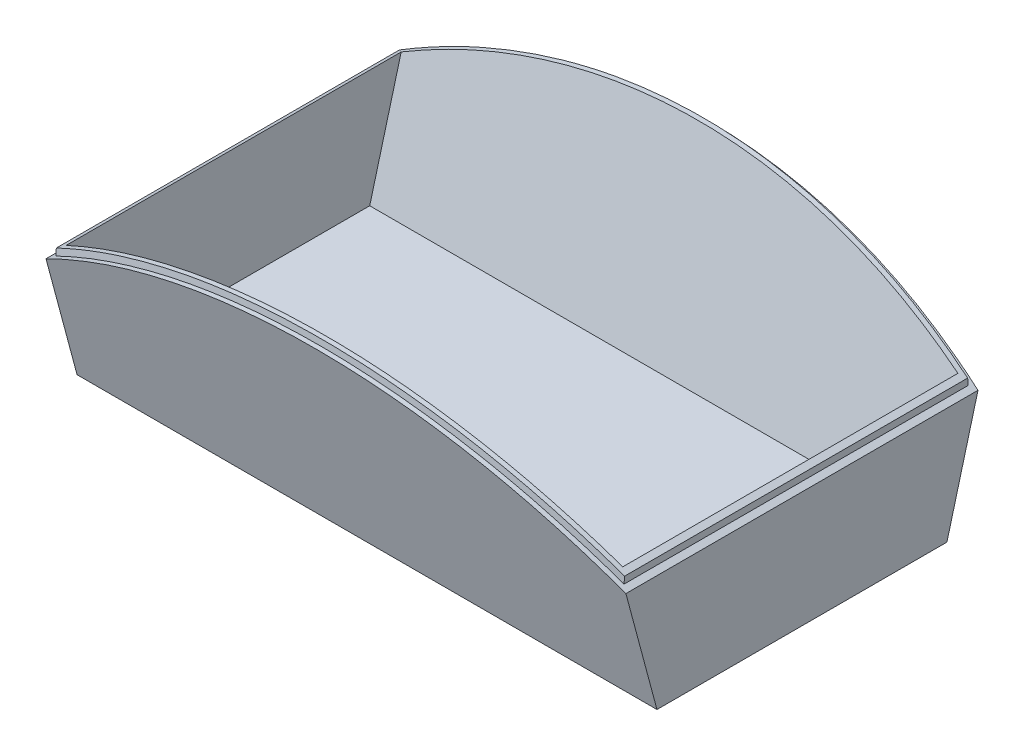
ISO-10303-21;
HEADER;
FILE_DESCRIPTION(('STEP AP214'),'2;1');
FILE_NAME('part.step','',(''),(''),'','','');
FILE_SCHEMA(('AUTOMOTIVE_DESIGN { 1 0 10303 214 1 1 1 1 }'));
ENDSEC;
DATA;
#1=APPLICATION_CONTEXT('core data for automotive mechanical design processes');
#2=APPLICATION_PROTOCOL_DEFINITION('international standard','automotive_design',2000,#1);
#3=PRODUCT_CONTEXT('',#1,'mechanical');
#4=PRODUCT('Part','Part','',(#3));
#5=PRODUCT_RELATED_PRODUCT_CATEGORY('part','',(#4));
#6=PRODUCT_DEFINITION_FORMATION('','',#4);
#7=PRODUCT_DEFINITION_CONTEXT('part definition',#1,'design');
#8=PRODUCT_DEFINITION('design','',#6,#7);
#9=PRODUCT_DEFINITION_SHAPE('','',#8);
#10=(LENGTH_UNIT() NAMED_UNIT(*) SI_UNIT(.MILLI.,.METRE.));
#11=(NAMED_UNIT(*) PLANE_ANGLE_UNIT() SI_UNIT($,.RADIAN.));
#12=(NAMED_UNIT(*) SI_UNIT($,.STERADIAN.) SOLID_ANGLE_UNIT());
#13=UNCERTAINTY_MEASURE_WITH_UNIT(LENGTH_MEASURE(1.E-05),#10,'distance_accuracy_value','');
#14=(GEOMETRIC_REPRESENTATION_CONTEXT(3) GLOBAL_UNCERTAINTY_ASSIGNED_CONTEXT((#13)) GLOBAL_UNIT_ASSIGNED_CONTEXT((#10,
#11,#12)) REPRESENTATION_CONTEXT('',''));
#15=CARTESIAN_POINT('',(0.,0.,0.));
#16=DIRECTION('',(0.,0.,1.));
#17=DIRECTION('',(1.,0.,0.));
#18=AXIS2_PLACEMENT_3D('',#15,#16,#17);
#19=CARTESIAN_POINT('',(0.,-66.6025403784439,-50.));
#20=DIRECTION('',(0.,0.,1.));
#21=DIRECTION('',(1.,0.,0.));
#22=AXIS2_PLACEMENT_3D('',#19,#20,#21);
#23=CYLINDRICAL_SURFACE('',#22,101.);
#24=CARTESIAN_POINT('',(0.,-66.6025403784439,5.08335073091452));
#25=DIRECTION('',(0.,-0.258819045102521,0.965925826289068));
#26=DIRECTION('',(0.,0.965925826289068,0.258819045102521));
#27=AXIS2_PLACEMENT_3D('',#24,#25,#26);
#28=ELLIPSE('',#27,104.562894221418,101.);
#29=CARTESIAN_POINT('',(48.,22.2625258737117,28.8946734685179));
#30=VERTEX_POINT('',#29);
#31=CARTESIAN_POINT('',(-48.,22.2625258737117,28.8946734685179));
#32=VERTEX_POINT('',#31);
#33=EDGE_CURVE('E572',#30,#32,#28,.T.);
#34=ORIENTED_EDGE('',*,*,#33,.T.);
#35=DIRECTION('',(0.,0.,1.));
#36=VECTOR('',#35,1.);
#37=CARTESIAN_POINT('',(-48.,22.2625258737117,-50.));
#38=LINE('',#37,#36);
#39=CARTESIAN_POINT('',(-48.,22.2625258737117,-28.8946734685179));
#40=VERTEX_POINT('',#39);
#41=EDGE_CURVE('E549',#32,#40,#38,.F.);
#42=ORIENTED_EDGE('',*,*,#41,.T.);
#43=CARTESIAN_POINT('',(0.,-66.6025403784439,-5.08335073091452));
#44=DIRECTION('',(0.,-0.258819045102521,-0.965925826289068));
#45=DIRECTION('',(0.,-0.965925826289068,0.258819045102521));
#46=AXIS2_PLACEMENT_3D('',#43,#44,#45);
#47=ELLIPSE('',#46,104.562894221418,101.);
#48=CARTESIAN_POINT('',(48.,22.2625258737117,-28.8946734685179));
#49=VERTEX_POINT('',#48);
#50=EDGE_CURVE('E530',#49,#40,#47,.F.);
#51=ORIENTED_EDGE('',*,*,#50,.F.);
#52=DIRECTION('',(0.,0.,1.));
#53=VECTOR('',#52,1.);
#54=CARTESIAN_POINT('',(48.,22.2625258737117,-50.));
#55=LINE('',#54,#53);
#56=EDGE_CURVE('E570',#49,#30,#55,.T.);
#57=ORIENTED_EDGE('',*,*,#56,.T.);
#58=EDGE_LOOP('',(#34,#42,#51,#57));
#59=FACE_BOUND('',#58,.T.);
#60=DIRECTION('',(0.,0.,1.));
#61=VECTOR('',#60,1.);
#62=CARTESIAN_POINT('',(-49.,21.7150682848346,-50.));
#63=LINE('',#62,#61);
#64=CARTESIAN_POINT('',(-49.,21.7150682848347,29.5815752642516));
#65=VERTEX_POINT('',#64);
#66=CARTESIAN_POINT('',(-49.,21.7150682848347,-29.5815752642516));
#67=VERTEX_POINT('',#66);
#68=EDGE_CURVE('E564',#65,#67,#63,.F.);
#69=ORIENTED_EDGE('',*,*,#68,.F.);
#70=CARTESIAN_POINT('',(49.0000000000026,21.7150682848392,29.5815752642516));
#71=CARTESIAN_POINT('',(48.3355022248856,22.0837471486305,29.6804127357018));
#72=CARTESIAN_POINT('',(47.6665909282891,22.4450583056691,29.7772989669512));
#73=CARTESIAN_POINT('',(45.645444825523,23.5074576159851,30.0622166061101));
#74=CARTESIAN_POINT('',(44.2804635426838,24.1860374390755,30.2442458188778));
#75=CARTESIAN_POINT('',(41.5194061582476,25.4814668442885,30.5916265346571));
#76=CARTESIAN_POINT('',(40.1233298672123,26.0983160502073,30.7569779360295));
#77=CARTESIAN_POINT('',(38.0089427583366,26.9757794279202,30.9921097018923));
#78=CARTESIAN_POINT('',(37.3011226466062,27.2601702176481,31.0683033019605));
#79=CARTESIAN_POINT('',(35.8788417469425,27.8129814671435,31.2164040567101));
#80=CARTESIAN_POINT('',(35.1643811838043,28.0814024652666,31.2883113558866));
#81=CARTESIAN_POINT('',(33.7284644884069,28.602367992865,31.4279051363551));
#82=CARTESIAN_POINT('',(33.007002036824,28.8548962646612,31.4955872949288));
#83=CARTESIAN_POINT('',(31.5581794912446,29.3436209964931,31.6267274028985));
#84=CARTESIAN_POINT('',(30.8308192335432,29.57981700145,31.6901852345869));
#85=CARTESIAN_POINT('',(28.6402467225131,30.2637416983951,31.8740986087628));
#86=CARTESIAN_POINT('',(27.1686769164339,30.6867583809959,31.9880809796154));
#87=CARTESIAN_POINT('',(24.2066635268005,31.4657161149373,32.1980046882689));
#88=CARTESIAN_POINT('',(22.7162195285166,31.8216556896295,32.2939456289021));
#89=CARTESIAN_POINT('',(19.7198370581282,32.4654940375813,32.4672674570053));
#90=CARTESIAN_POINT('',(18.2139014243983,32.7534050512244,32.5446516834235));
#91=CARTESIAN_POINT('',(15.9466193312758,33.1335713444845,32.6465666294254));
#92=CARTESIAN_POINT('',(15.1898284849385,33.2516323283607,32.6781662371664));
#93=CARTESIAN_POINT('',(13.6735570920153,33.4705361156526,32.7366577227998));
#94=CARTESIAN_POINT('',(12.9140764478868,33.5713782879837,32.7635494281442));
#95=CARTESIAN_POINT('',(10.6249313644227,33.8488455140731,32.8373864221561));
#96=CARTESIAN_POINT('',(9.09172582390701,33.9992094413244,32.8771716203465));
#97=CARTESIAN_POINT('',(6.78777490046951,34.1720580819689,32.9226844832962));
#98=CARTESIAN_POINT('',(6.01901788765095,34.2208938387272,32.9354952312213));
#99=CARTESIAN_POINT('',(4.48050813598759,34.300969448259,32.9564425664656));
#100=CARTESIAN_POINT('',(3.71075540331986,34.3322094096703,32.9645791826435));
#101=CARTESIAN_POINT('',(2.16965781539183,34.3770994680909,32.9762359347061));
#102=CARTESIAN_POINT('',(1.39831221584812,34.3907256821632,32.9797498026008));
#103=CARTESIAN_POINT('',(0.241221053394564,34.3979080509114,32.9816124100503));
#104=CARTESIAN_POINT('',(-0.144490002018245,34.3980926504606,32.9816652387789));
#105=CARTESIAN_POINT('',(-0.915888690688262,34.394043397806,32.9805666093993));
#106=CARTESIAN_POINT('',(-1.30157632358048,34.3898094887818,32.9794151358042));
#107=CARTESIAN_POINT('',(-3.22989091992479,34.3575904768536,32.9706799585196));
#108=CARTESIAN_POINT('',(-4.77207601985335,34.2964570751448,32.9541628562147));
#109=CARTESIAN_POINT('',(-8.14085126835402,34.0855158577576,32.8975263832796));
#110=CARTESIAN_POINT('',(-9.96647142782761,33.9212132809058,32.8535576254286));
#111=CARTESIAN_POINT('',(-13.6059307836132,33.4935999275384,32.7392906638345));
#112=CARTESIAN_POINT('',(-15.4197651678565,33.2302510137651,32.6689823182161));
#113=CARTESIAN_POINT('',(-19.029713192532,32.6054515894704,32.5017925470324));
#114=CARTESIAN_POINT('',(-20.8258231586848,32.2439811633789,32.4049057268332));
#115=CARTESIAN_POINT('',(-23.501862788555,31.6293311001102,32.2399587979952));
#116=CARTESIAN_POINT('',(-24.3908769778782,31.4123673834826,32.1817053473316));
#117=CARTESIAN_POINT('',(-26.162287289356,30.9544761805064,32.0587559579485));
#118=CARTESIAN_POINT('',(-27.0446834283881,30.7135487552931,31.9940600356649));
#119=CARTESIAN_POINT('',(-28.8019784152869,30.2080053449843,31.8583826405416));
#120=CARTESIAN_POINT('',(-29.6768787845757,29.943394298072,31.7874024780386));
#121=CARTESIAN_POINT('',(-31.4186778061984,29.390697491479,31.63926757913));
#122=CARTESIAN_POINT('',(-32.2855763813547,29.1026115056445,31.5621127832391));
#123=CARTESIAN_POINT('',(-34.8724894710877,28.2037906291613,31.3213981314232));
#124=CARTESIAN_POINT('',(-36.579743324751,27.5581986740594,31.1485092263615));
#125=CARTESIAN_POINT('',(-39.1883095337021,26.4902538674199,30.8623146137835));
#126=CARTESIAN_POINT('',(-40.1037283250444,26.0995678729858,30.75758004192));
#127=CARTESIAN_POINT('',(-41.9217620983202,25.2917189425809,30.5409479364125));
#128=CARTESIAN_POINT('',(-42.824379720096,24.8745615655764,30.4290519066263));
#129=CARTESIAN_POINT('',(-44.6140201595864,24.0151852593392,30.1985072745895));
#130=CARTESIAN_POINT('',(-45.5010751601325,23.5730287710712,30.0798754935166));
#131=CARTESIAN_POINT('',(-47.2612350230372,22.6631170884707,29.8357890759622));
#132=CARTESIAN_POINT('',(-48.1343370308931,22.1953567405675,29.710333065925));
#133=CARTESIAN_POINT('',(-49.,21.7150682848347,29.5815752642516));
#134=B_SPLINE_CURVE_WITH_KNOTS('',3,(#70,#71,#72,#73,#74,#75,#76,#77,#78,#79,#80,#81,#82,#83,
#84,#85,#86,#87,#88,#89,#90,#91,#92,#93,#94,#95,#96,#97,#98,#99,#100,#101,#102,#103,#104,#105,
#106,#107,#108,#109,#110,#111,#112,#113,#114,#115,#116,#117,#118,#119,#120,#121,#122,#123,#124,
#125,#126,#127,#128,#129,#130,#131,#132,#133),.UNSPECIFIED.,.F.,.F.,(4,2,2,2,2,2,2,2,2,2,2,2,2,
2,2,2,2,2,2,2,2,2,2,2,2,2,2,2,2,2,2,4),(0.,2.29899845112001,6.90283129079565,11.5066921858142,
13.8063535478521,16.1059373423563,18.4078365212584,20.7097998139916,25.3141560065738,
29.9186135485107,34.5222419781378,36.8218434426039,39.1215291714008,43.7426877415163,
46.0537643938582,48.3648267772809,50.6790195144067,51.8361271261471,52.9932496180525,
57.6218107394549,63.1194614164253,68.6192311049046,74.1201179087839,76.8706980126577,
79.621271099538,82.3712720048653,85.1212994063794,90.6181593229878,93.6201934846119,
96.6215992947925,99.6158138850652,102.610633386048),.UNSPECIFIED.);
#135=CARTESIAN_POINT('',(49.0000000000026,21.7150682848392,29.5815752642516));
#136=VERTEX_POINT('',#135);
#137=EDGE_CURVE('E569',#136,#65,#134,.T.);
#138=ORIENTED_EDGE('',*,*,#137,.F.);
#139=DIRECTION('',(0.,0.,1.));
#140=VECTOR('',#139,1.);
#141=CARTESIAN_POINT('',(49.,21.7150682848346,-50.));
#142=LINE('',#141,#140);
#143=CARTESIAN_POINT('',(49.0000000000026,21.7150682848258,-29.5815752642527));
#144=VERTEX_POINT('',#143);
#145=EDGE_CURVE('E567',#144,#136,#142,.T.);
#146=ORIENTED_EDGE('',*,*,#145,.F.);
#147=CARTESIAN_POINT('',(49.0000000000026,21.7150682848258,-29.5815752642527));
#148=CARTESIAN_POINT('',(48.3355022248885,22.0837471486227,-29.6804127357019));
#149=CARTESIAN_POINT('',(47.6665909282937,22.4450583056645,-29.7772989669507));
#150=CARTESIAN_POINT('',(45.6454448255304,23.5074576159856,-30.0622166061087));
#151=CARTESIAN_POINT('',(44.28046354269,24.1860374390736,-30.2442458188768));
#152=CARTESIAN_POINT('',(41.519406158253,25.4814668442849,-30.5916265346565));
#153=CARTESIAN_POINT('',(40.123329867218,26.0983160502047,-30.7569779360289));
#154=CARTESIAN_POINT('',(38.0089427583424,26.975779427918,-30.9921097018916));
#155=CARTESIAN_POINT('',(37.301122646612,27.2601702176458,-31.0683033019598));
#156=CARTESIAN_POINT('',(35.8788417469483,27.8129814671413,-31.2164040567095));
#157=CARTESIAN_POINT('',(35.1643811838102,28.0814024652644,-31.288311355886));
#158=CARTESIAN_POINT('',(33.7284644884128,28.602367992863,-31.4279051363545));
#159=CARTESIAN_POINT('',(33.0070020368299,28.8548962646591,-31.4955872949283));
#160=CARTESIAN_POINT('',(31.5581794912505,29.3436209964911,-31.626727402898));
#161=CARTESIAN_POINT('',(30.8308192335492,29.579817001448,-31.6901852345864));
#162=CARTESIAN_POINT('',(28.6402467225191,30.2637416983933,-31.8740986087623));
#163=CARTESIAN_POINT('',(27.16867691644,30.6867583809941,-31.988080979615));
#164=CARTESIAN_POINT('',(24.2066635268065,31.4657161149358,-32.1980046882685));
#165=CARTESIAN_POINT('',(22.7162195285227,31.8216556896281,-32.2939456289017));
#166=CARTESIAN_POINT('',(19.7198370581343,32.4654940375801,-32.4672674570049));
#167=CARTESIAN_POINT('',(18.2139014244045,32.7534050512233,-32.5446516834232));
#168=CARTESIAN_POINT('',(15.946619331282,33.1335713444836,-32.6465666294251));
#169=CARTESIAN_POINT('',(15.1898284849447,33.2516323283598,-32.6781662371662));
#170=CARTESIAN_POINT('',(13.6735570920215,33.4705361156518,-32.7366577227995));
#171=CARTESIAN_POINT('',(12.9140764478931,33.5713782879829,-32.7635494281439));
#172=CARTESIAN_POINT('',(10.6249313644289,33.8488455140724,-32.8373864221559));
#173=CARTESIAN_POINT('',(9.09172582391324,33.9992094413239,-32.8771716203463));
#174=CARTESIAN_POINT('',(6.78777490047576,34.1720580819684,-32.9226844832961));
#175=CARTESIAN_POINT('',(6.01901788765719,34.2208938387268,-32.9354952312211));
#176=CARTESIAN_POINT('',(4.48050813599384,34.3009694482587,-32.9564425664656));
#177=CARTESIAN_POINT('',(3.71075540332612,34.3322094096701,-32.9645791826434));
#178=CARTESIAN_POINT('',(2.16965781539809,34.3770994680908,-32.976235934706));
#179=CARTESIAN_POINT('',(1.39831221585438,34.3907256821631,-32.9797498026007));
#180=CARTESIAN_POINT('',(0.241221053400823,34.3979080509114,-32.9816124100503));
#181=CARTESIAN_POINT('',(-0.144490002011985,34.3980926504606,-32.9816652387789));
#182=CARTESIAN_POINT('',(-0.915888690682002,34.394043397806,-32.9805666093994));
#183=CARTESIAN_POINT('',(-1.30157632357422,34.3898094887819,-32.9794151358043));
#184=CARTESIAN_POINT('',(-3.22989091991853,34.3575904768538,-32.9706799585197));
#185=CARTESIAN_POINT('',(-4.77207601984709,34.2964570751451,-32.9541628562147));
#186=CARTESIAN_POINT('',(-8.14085126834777,34.0855158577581,-32.8975263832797));
#187=CARTESIAN_POINT('',(-9.96647142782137,33.9212132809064,-32.8535576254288));
#188=CARTESIAN_POINT('',(-13.605930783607,33.4935999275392,-32.7392906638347));
#189=CARTESIAN_POINT('',(-15.4197651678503,33.230251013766,-32.6689823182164));
#190=CARTESIAN_POINT('',(-19.0297131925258,32.6054515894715,-32.5017925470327));
#191=CARTESIAN_POINT('',(-20.8258231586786,32.2439811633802,-32.4049057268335));
#192=CARTESIAN_POINT('',(-23.5018627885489,31.6293311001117,-32.2399587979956));
#193=CARTESIAN_POINT('',(-24.3908769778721,31.4123673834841,-32.181705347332));
#194=CARTESIAN_POINT('',(-26.1622872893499,30.954476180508,-32.0587559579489));
#195=CARTESIAN_POINT('',(-27.0446834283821,30.7135487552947,-31.9940600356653));
#196=CARTESIAN_POINT('',(-28.8019784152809,30.2080053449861,-31.8583826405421));
#197=CARTESIAN_POINT('',(-29.6768787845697,29.9433942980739,-31.7874024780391));
#198=CARTESIAN_POINT('',(-31.4186778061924,29.3906974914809,-31.6392675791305));
#199=CARTESIAN_POINT('',(-32.2855763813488,29.1026115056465,-31.5621127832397));
#200=CARTESIAN_POINT('',(-34.8724894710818,28.2037906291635,-31.3213981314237));
#201=CARTESIAN_POINT('',(-36.5797433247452,27.5581986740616,-31.1485092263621));
#202=CARTESIAN_POINT('',(-39.1883095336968,26.4902538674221,-30.8623146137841));
#203=CARTESIAN_POINT('',(-40.1037283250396,26.0995678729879,-30.7575800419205));
#204=CARTESIAN_POINT('',(-41.9217620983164,25.2917189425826,-30.540947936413));
#205=CARTESIAN_POINT('',(-42.8243797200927,24.874561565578,-30.4290519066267));
#206=CARTESIAN_POINT('',(-44.6140201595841,24.0151852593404,-30.1985072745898));
#207=CARTESIAN_POINT('',(-45.5010751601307,23.5730287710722,-30.0798754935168));
#208=CARTESIAN_POINT('',(-47.2612350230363,22.6631170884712,-29.8357890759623));
#209=CARTESIAN_POINT('',(-48.1343370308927,22.1953567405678,-29.710333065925));
#210=CARTESIAN_POINT('',(-49.,21.7150682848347,-29.5815752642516));
#211=B_SPLINE_CURVE_WITH_KNOTS('',3,(#147,#148,#149,#150,#151,#152,#153,#154,#155,#156,#157,
#158,#159,#160,#161,#162,#163,#164,#165,#166,#167,#168,#169,#170,#171,#172,#173,#174,#175,#176,
#177,#178,#179,#180,#181,#182,#183,#184,#185,#186,#187,#188,#189,#190,#191,#192,#193,#194,#195,
#196,#197,#198,#199,#200,#201,#202,#203,#204,#205,#206,#207,#208,#209,#210),.UNSPECIFIED.,.F.,
.F.,(4,2,2,2,2,2,2,2,2,2,2,2,2,2,2,2,2,2,2,2,2,2,2,2,2,2,2,2,2,2,2,4),(0.,2.29899845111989,
6.90283129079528,11.506692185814,13.806353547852,16.1059373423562,18.4078365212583,
20.7097998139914,25.3141560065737,29.9186135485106,34.5222419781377,36.8218434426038,
39.1215291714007,43.7426877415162,46.0537643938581,48.3648267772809,50.6790195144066,
51.836127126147,52.9932496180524,57.6218107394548,63.1194614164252,68.6192311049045,
74.1201179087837,76.8706980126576,79.6212710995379,82.3712720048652,85.1212994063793,
90.6181593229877,93.6201934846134,96.6215992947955,99.6158138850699,102.610633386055),.UNSPECIFIED.);
#212=EDGE_CURVE('E415',#144,#67,#211,.T.);
#213=ORIENTED_EDGE('',*,*,#212,.T.);
#214=EDGE_LOOP('',(#69,#138,#146,#213));
#215=FACE_BOUND('',#214,.T.);
#216=ADVANCED_FACE('F391',(#59,#215),#23,.T.);
#217=CARTESIAN_POINT('',(-49.,21.7265219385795,-29.5806102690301));
#218=CARTESIAN_POINT('',(-43.473818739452,24.7921293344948,-30.4024231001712));
#219=CARTESIAN_POINT('',(-36.7016954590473,27.7668626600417,-31.199898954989));
#220=CARTESIAN_POINT('',(-24.3959993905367,31.5993838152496,-32.2273493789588));
#221=CARTESIAN_POINT('',(-13.9567033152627,33.7882441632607,-32.8141664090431));
#222=CARTESIAN_POINT('',(-4.25655860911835,34.409595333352,-32.9807474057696));
#223=CARTESIAN_POINT('',(10.8177246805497,34.4020766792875,-32.9787317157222));
#224=CARTESIAN_POINT('',(22.3248052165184,32.5561956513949,-32.4838537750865));
#225=CARTESIAN_POINT('',(38.5558555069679,26.9504739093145,-30.9810388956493));
#226=CARTESIAN_POINT('',(44.3544069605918,24.3036326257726,-30.2714692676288));
#227=CARTESIAN_POINT('',(49.0000000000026,21.7265219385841,-29.5806102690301));
#228=CARTESIAN_POINT('',(-49.,21.7227040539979,-29.5809319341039));
#229=CARTESIAN_POINT('',(-43.4737218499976,24.7885002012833,-30.4027927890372));
#230=CARTESIAN_POINT('',(-36.7013756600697,27.7634071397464,-31.2003125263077));
#231=CARTESIAN_POINT('',(-24.3959671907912,31.5959546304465,-32.2277665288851));
#232=CARTESIAN_POINT('',(-13.9565304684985,33.7849129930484,-32.814607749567));
#233=CARTESIAN_POINT('',(-4.25661273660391,34.406256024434,-32.9811859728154));
#234=CARTESIAN_POINT('',(10.8173658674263,34.3987584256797,-32.9791759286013));
#235=CARTESIAN_POINT('',(22.3252898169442,32.5526614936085,-32.4842419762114));
#236=CARTESIAN_POINT('',(38.5559170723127,26.946837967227,-30.9814048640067));
#237=CARTESIAN_POINT('',(44.3544599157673,24.2998978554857,-30.2718110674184));
#238=CARTESIAN_POINT('',(49.0000000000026,21.7227040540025,-29.5809319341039));
#239=CARTESIAN_POINT('',(-49.,21.7188861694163,-29.5812535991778));
#240=CARTESIAN_POINT('',(-43.4736249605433,24.7848710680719,-30.4031624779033));
#241=CARTESIAN_POINT('',(-36.7010558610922,27.7599516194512,-31.2007260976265));
#242=CARTESIAN_POINT('',(-24.3959349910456,31.5925254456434,-32.2281836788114));
#243=CARTESIAN_POINT('',(-13.9563576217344,33.781581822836,-32.8150490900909));
#244=CARTESIAN_POINT('',(-4.25666686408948,34.4029167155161,-32.9816245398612));
#245=CARTESIAN_POINT('',(10.8170070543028,34.3954401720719,-32.9796201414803));
#246=CARTESIAN_POINT('',(22.32577441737,32.5491273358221,-32.4846301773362));
#247=CARTESIAN_POINT('',(38.5559786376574,26.9432020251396,-30.981770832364));
#248=CARTESIAN_POINT('',(44.3545128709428,24.2961630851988,-30.272152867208));
#249=CARTESIAN_POINT('',(49.0000000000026,21.7188861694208,-29.5812535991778));
#250=CARTESIAN_POINT('',(-49.,21.7150682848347,-29.5815752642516));
#251=CARTESIAN_POINT('',(-43.473528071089,24.7812419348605,-30.4035321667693));
#252=CARTESIAN_POINT('',(-36.7007360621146,27.7564960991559,-31.2011396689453));
#253=CARTESIAN_POINT('',(-24.3959027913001,31.5890962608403,-32.2286008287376));
#254=CARTESIAN_POINT('',(-13.9561847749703,33.7782506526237,-32.8154904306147));
#255=CARTESIAN_POINT('',(-4.25672099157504,34.3995774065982,-32.982063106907));
#256=CARTESIAN_POINT('',(10.8166482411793,34.3921219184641,-32.9800643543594));
#257=CARTESIAN_POINT('',(22.3262590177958,32.5455931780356,-32.485018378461));
#258=CARTESIAN_POINT('',(38.5560402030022,26.9395660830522,-30.9821368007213));
#259=CARTESIAN_POINT('',(44.3545658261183,24.2924283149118,-30.2724946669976));
#260=CARTESIAN_POINT('',(49.0000000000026,21.7150682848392,-29.5815752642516));
#261=CARTESIAN_POINT('',(-49.,21.3332798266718,-29.6137417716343));
#262=CARTESIAN_POINT('',(-43.4638391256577,24.4183286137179,-30.4405010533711));
#263=CARTESIAN_POINT('',(-36.6687561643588,27.4109440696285,-31.2424968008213));
#264=CARTESIAN_POINT('',(-24.3926828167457,31.2461777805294,-32.2703158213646));
#265=CARTESIAN_POINT('',(-13.9389000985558,33.4451336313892,-32.8596244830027));
#266=CARTESIAN_POINT('',(-4.26213374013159,34.065646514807,-33.0259198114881));
#267=CARTESIAN_POINT('',(10.7807669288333,34.0602965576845,-33.0244856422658));
#268=CARTESIAN_POINT('',(22.3747190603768,32.192177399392,-32.523838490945));
#269=CARTESIAN_POINT('',(38.5621967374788,26.5759718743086,-31.018733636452));
#270=CARTESIAN_POINT('',(44.3598613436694,23.918951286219,-30.3066746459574));
#271=CARTESIAN_POINT('',(49.0000000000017,21.3332798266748,-29.6137417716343));
#272=CARTESIAN_POINT('',(-49.,20.951491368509,-29.645908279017));
#273=CARTESIAN_POINT('',(-43.4541501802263,24.0554152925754,-30.477469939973));
#274=CARTESIAN_POINT('',(-36.6367762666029,27.0653920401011,-31.2838539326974));
#275=CARTESIAN_POINT('',(-24.3894628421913,30.9032593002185,-32.3120308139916));
#276=CARTESIAN_POINT('',(-13.9216154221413,33.1120166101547,-32.9037585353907));
#277=CARTESIAN_POINT('',(-4.26754648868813,33.7317156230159,-33.0697765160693));
#278=CARTESIAN_POINT('',(10.7448856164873,33.7284711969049,-33.0689069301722));
#279=CARTESIAN_POINT('',(22.4231791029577,31.8387616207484,-32.5626586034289));
#280=CARTESIAN_POINT('',(38.5683532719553,26.212377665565,-31.0553304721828));
#281=CARTESIAN_POINT('',(44.3651568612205,23.5454742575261,-30.3408546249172));
#282=CARTESIAN_POINT('',(49.0000000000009,20.9514913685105,-29.645908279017));
#283=CARTESIAN_POINT('',(-49.,20.5697029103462,-29.6780747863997));
#284=CARTESIAN_POINT('',(-43.444461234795,23.6925019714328,-30.5144388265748));
#285=CARTESIAN_POINT('',(-36.6047963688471,26.7198400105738,-31.3252110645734));
#286=CARTESIAN_POINT('',(-24.3862428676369,30.5603408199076,-32.3537458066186));
#287=CARTESIAN_POINT('',(-13.9043307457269,32.7788995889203,-32.9478925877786));
#288=CARTESIAN_POINT('',(-4.27295923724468,33.3977847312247,-33.1136332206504));
#289=CARTESIAN_POINT('',(10.7090043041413,33.3966458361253,-33.1133282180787));
#290=CARTESIAN_POINT('',(22.4716391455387,31.4853458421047,-32.6014787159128));
#291=CARTESIAN_POINT('',(38.5745098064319,25.8487834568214,-31.0919273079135));
#292=CARTESIAN_POINT('',(44.3704523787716,23.1719972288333,-30.375034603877));
#293=CARTESIAN_POINT('',(49.0000000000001,20.5697029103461,-29.6780747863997));
#294=CARTESIAN_POINT('',(-49.,20.5658850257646,-29.6783964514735));
#295=CARTESIAN_POINT('',(-43.4443643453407,23.6888728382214,-30.5148085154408));
#296=CARTESIAN_POINT('',(-36.6044765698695,26.7163844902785,-31.3256246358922));
#297=CARTESIAN_POINT('',(-24.3862106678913,30.5569116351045,-32.3541629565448));
#298=CARTESIAN_POINT('',(-13.9041578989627,32.7755684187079,-32.9483339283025));
#299=CARTESIAN_POINT('',(-4.27301336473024,33.3944454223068,-33.1140717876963));
#300=CARTESIAN_POINT('',(10.7086454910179,33.3933275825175,-33.1137724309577));
#301=CARTESIAN_POINT('',(22.4721237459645,31.4818116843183,-32.6018669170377));
#302=CARTESIAN_POINT('',(38.5745713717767,25.8451475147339,-31.0922932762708));
#303=CARTESIAN_POINT('',(44.3705053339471,23.1682624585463,-30.3753764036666));
#304=CARTESIAN_POINT('',(49.0000000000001,20.5658850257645,-29.6783964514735));
#305=CARTESIAN_POINT('',(-49.,20.5620671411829,-29.6787181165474));
#306=CARTESIAN_POINT('',(-43.4442674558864,23.68524370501,-30.5151782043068));
#307=CARTESIAN_POINT('',(-36.604156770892,26.7129289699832,-31.326038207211));
#308=CARTESIAN_POINT('',(-24.3861784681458,30.5534824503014,-32.3545801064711));
#309=CARTESIAN_POINT('',(-13.9039850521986,32.7722372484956,-32.9487752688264));
#310=CARTESIAN_POINT('',(-4.27306749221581,33.3911061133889,-33.1145103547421));
#311=CARTESIAN_POINT('',(10.7082866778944,33.3900093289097,-33.1142166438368));
#312=CARTESIAN_POINT('',(22.4726083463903,31.4782775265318,-32.6022551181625));
#313=CARTESIAN_POINT('',(38.5746329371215,25.8415115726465,-31.0926592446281));
#314=CARTESIAN_POINT('',(44.3705582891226,23.1645276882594,-30.3757182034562));
#315=CARTESIAN_POINT('',(49.0000000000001,20.5620671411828,-29.6787181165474));
#316=CARTESIAN_POINT('',(-49.,20.5582492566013,-29.6790397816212));
#317=CARTESIAN_POINT('',(-43.444170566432,23.6816145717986,-30.5155478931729));
#318=CARTESIAN_POINT('',(-36.6038369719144,26.7094734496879,-31.3264517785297));
#319=CARTESIAN_POINT('',(-24.3861462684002,30.5500532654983,-32.3549972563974));
#320=CARTESIAN_POINT('',(-13.9038122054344,32.7689060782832,-32.9492166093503));
#321=CARTESIAN_POINT('',(-4.27312161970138,33.387766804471,-33.1149489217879));
#322=CARTESIAN_POINT('',(10.7079278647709,33.3866910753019,-33.1146608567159));
#323=CARTESIAN_POINT('',(22.4730929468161,31.4747433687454,-32.6026433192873));
#324=CARTESIAN_POINT('',(38.5746945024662,25.837875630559,-31.0930252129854));
#325=CARTESIAN_POINT('',(44.3706112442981,23.1607929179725,-30.3760600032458));
#326=CARTESIAN_POINT('',(49.0000000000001,20.5582492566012,-29.6790397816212));
#327=B_SPLINE_SURFACE_WITH_KNOTS('',3,3,((#217,#218,#219,#220,#221,#222,#223,#224,#225,#226,
#227),(#228,#229,#230,#231,#232,#233,#234,#235,#236,#237,#238),(#239,#240,#241,#242,#243,#244,
#245,#246,#247,#248,#249),(#250,#251,#252,#253,#254,#255,#256,#257,#258,#259,#260),(#261,#262,
#263,#264,#265,#266,#267,#268,#269,#270,#271),(#272,#273,#274,#275,#276,#277,#278,#279,#280,
#281,#282),(#283,#284,#285,#286,#287,#288,#289,#290,#291,#292,#293),(#294,#295,#296,#297,#298,
#299,#300,#301,#302,#303,#304),(#305,#306,#307,#308,#309,#310,#311,#312,#313,#314,#315),(#316,
#317,#318,#319,#320,#321,#322,#323,#324,#325,#326)),.UNSPECIFIED.,.F.,.F.,.F.,(4,3,3,4),(4,1,1,
1,2,1,1,4),(-0.01,0.,1.,1.01),(0.,0.187499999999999,0.218749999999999,0.374999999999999,0.5,
0.8125,0.84375,1.),.UNSPECIFIED.);
#328=CARTESIAN_POINT('',(49.0000000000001,20.5697029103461,-29.6780747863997));
#329=CARTESIAN_POINT('',(49.0000000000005,20.7605971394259,-29.6619915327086));
#330=CARTESIAN_POINT('',(49.0000000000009,20.9514913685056,-29.6459082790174));
#331=CARTESIAN_POINT('',(49.0000000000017,21.3332798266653,-29.6137417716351));
#332=CARTESIAN_POINT('',(49.0000000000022,21.5241740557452,-29.5976585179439));
#333=CARTESIAN_POINT('',(49.0000000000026,21.7150682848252,-29.5815752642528));
#334=B_SPLINE_CURVE_WITH_KNOTS('',3,(#328,#329,#330,#331,#332,#333),.UNSPECIFIED.,.F.,.F.,(4,2,
4),(0.,0.574711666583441,1.14942333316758),.UNSPECIFIED.);
#335=CARTESIAN_POINT('',(49.0000000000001,20.5697029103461,-29.6780747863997));
#336=VERTEX_POINT('',#335);
#337=EDGE_CURVE('E398',#336,#144,#334,.T.);
#338=CARTESIAN_POINT('',(-49.,20.5697029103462,-29.6780747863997));
#339=CARTESIAN_POINT('',(-48.3376643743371,20.9420115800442,-29.7777873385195));
#340=CARTESIAN_POINT('',(-47.6708207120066,21.3069103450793,-29.8755085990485));
#341=CARTESIAN_POINT('',(-45.65567914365,22.3799093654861,-30.1628508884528));
#342=CARTESIAN_POINT('',(-44.2943784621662,23.0653595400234,-30.3463952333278));
#343=CARTESIAN_POINT('',(-41.5399660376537,24.3741425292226,-30.6968720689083));
#344=CARTESIAN_POINT('',(-40.1468500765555,24.9974670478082,-30.8638023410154));
#345=CARTESIAN_POINT('',(-37.331943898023,26.1803052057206,-31.1806059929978));
#346=CARTESIAN_POINT('',(-35.910154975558,26.7398217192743,-31.3304801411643));
#347=CARTESIAN_POINT('',(-33.0408994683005,27.7936180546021,-31.6127514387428));
#348=CARTESIAN_POINT('',(-31.593432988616,28.2878981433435,-31.7451486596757));
#349=CARTESIAN_POINT('',(-28.6758477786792,29.2099675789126,-31.9920912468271));
#350=CARTESIAN_POINT('',(-27.2057270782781,29.6377511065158,-32.1066350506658));
#351=CARTESIAN_POINT('',(-24.2463169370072,30.4256010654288,-32.317591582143));
#352=CARTESIAN_POINT('',(-22.7570301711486,30.785676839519,-32.4140068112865));
#353=CARTESIAN_POINT('',(-20.5120177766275,31.2741322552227,-32.544820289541));
#354=CARTESIAN_POINT('',(-19.762208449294,31.4282772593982,-32.5861061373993));
#355=CARTESIAN_POINT('',(-18.2589947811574,31.7193554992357,-32.664074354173));
#356=CARTESIAN_POINT('',(-17.5055903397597,31.8562882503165,-32.7007565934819));
#357=CARTESIAN_POINT('',(-15.2389824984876,32.2413974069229,-32.8039239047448));
#358=CARTESIAN_POINT('',(-13.7209560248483,32.4635427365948,-32.8634379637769));
#359=CARTESIAN_POINT('',(-10.6756740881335,32.8378107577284,-32.9636656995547));
#360=CARTESIAN_POINT('',(-9.14841860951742,32.9899333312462,-33.0043793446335));
#361=CARTESIAN_POINT('',(-6.85417121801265,33.165229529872,-33.0513128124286));
#362=CARTESIAN_POINT('',(-6.08926177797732,33.2148348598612,-33.0645978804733));
#363=CARTESIAN_POINT('',(-4.5584675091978,33.2964479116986,-33.0864595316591));
#364=CARTESIAN_POINT('',(-3.79258271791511,33.3284562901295,-33.0950362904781));
#365=CARTESIAN_POINT('',(-1.49245981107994,33.398096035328,-33.113714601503));
#366=CARTESIAN_POINT('',(0.0427284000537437,33.409225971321,-33.1167331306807));
#367=CARTESIAN_POINT('',(3.11213804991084,33.3608087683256,-33.1035961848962));
#368=CARTESIAN_POINT('',(4.64635925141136,33.3012482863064,-33.0874370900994));
#369=CARTESIAN_POINT('',(7.71012744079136,33.1115991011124,-33.0362126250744));
#370=CARTESIAN_POINT('',(9.23967440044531,32.9815099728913,-33.0011471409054));
#371=CARTESIAN_POINT('',(12.2903613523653,32.6511762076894,-32.9123280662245));
#372=CARTESIAN_POINT('',(13.811503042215,32.450946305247,-32.8585784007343));
#373=CARTESIAN_POINT('',(16.0835899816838,32.098548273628,-32.7641300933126));
#374=CARTESIAN_POINT('',(16.8389629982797,31.9724847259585,-32.7303642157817));
#375=CARTESIAN_POINT('',(18.3465008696,31.7030662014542,-32.6582396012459));
#376=CARTESIAN_POINT('',(19.0986652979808,31.5597089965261,-32.6198802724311));
#377=CARTESIAN_POINT('',(21.3572706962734,31.1022953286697,-32.4975338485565));
#378=CARTESIAN_POINT('',(22.8581235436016,30.7620906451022,-32.4065982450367));
#379=CARTESIAN_POINT('',(25.8416739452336,30.0130588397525,-32.2064107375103));
#380=CARTESIAN_POINT('',(27.3243679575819,29.6042185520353,-32.0971553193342));
#381=CARTESIAN_POINT('',(29.5324905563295,28.9402429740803,-31.9196213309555));
#382=CARTESIAN_POINT('',(30.2661467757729,28.7103708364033,-31.8581429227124));
#383=CARTESIAN_POINT('',(31.727598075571,28.2338991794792,-31.7306443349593));
#384=CARTESIAN_POINT('',(32.4553931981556,27.9872997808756,-31.6646241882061));
#385=CARTESIAN_POINT('',(34.6292503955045,27.2226928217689,-31.4599037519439));
#386=CARTESIAN_POINT('',(36.0660464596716,26.6797976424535,-31.3145223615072));
#387=CARTESIAN_POINT('',(38.4784562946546,25.7042774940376,-31.0532908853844));
#388=CARTESIAN_POINT('',(39.4613764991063,25.2883612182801,-30.9419145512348));
#389=CARTESIAN_POINT('',(41.4125980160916,24.4256665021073,-30.7108769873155));
#390=CARTESIAN_POINT('',(42.3808996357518,23.9788887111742,-30.5912159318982));
#391=CARTESIAN_POINT('',(44.3006944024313,23.0555968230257,-30.3439169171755));
#392=CARTESIAN_POINT('',(45.2522067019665,22.5791198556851,-30.2162889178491));
#393=CARTESIAN_POINT('',(47.1387292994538,21.5965056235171,-29.953092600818));
#394=CARTESIAN_POINT('',(48.0737388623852,21.0903670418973,-29.8175239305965));
#395=CARTESIAN_POINT('',(49.0000000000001,20.5697029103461,-29.6780747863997));
#396=B_SPLINE_CURVE_WITH_KNOTS('',3,(#338,#339,#340,#341,#342,#343,#344,#345,#346,#347,#348,
#349,#350,#351,#352,#353,#354,#355,#356,#357,#358,#359,#360,#361,#362,#363,#364,#365,#366,#367,
#368,#369,#370,#371,#372,#373,#374,#375,#376,#377,#378,#379,#380,#381,#382,#383,#384,#385,#386,
#387,#388,#389,#390,#391,#392,#393,#394,#395),.UNSPECIFIED.,.F.,.F.,(4,2,2,2,2,2,2,2,2,2,2,2,2,
2,2,2,2,2,2,2,2,2,2,2,2,2,2,2,4),(0.,2.29900159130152,6.90265778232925,11.506927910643,
16.1109905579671,20.7150343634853,25.3194808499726,29.9232915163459,32.2229135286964,
34.5226002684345,39.1268012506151,43.731009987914,46.0307133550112,48.3303309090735,
52.9341308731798,57.5387999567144,62.1434967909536,66.7472268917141,69.046733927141,
71.3465375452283,75.9695169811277,80.5933842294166,82.9070300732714,85.2206592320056,
89.8470946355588,93.0658603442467,96.2845583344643,99.4993100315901,102.71420455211),.UNSPECIFIED.);
#397=CARTESIAN_POINT('',(-49.,20.5697029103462,-29.6780747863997));
#398=VERTEX_POINT('',#397);
#399=EDGE_CURVE('E563',#398,#336,#396,.T.);
#400=CARTESIAN_POINT('',(-49.,21.7150682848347,-29.5815752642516));
#401=CARTESIAN_POINT('',(-49.,21.6196211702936,-29.5896168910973));
#402=CARTESIAN_POINT('',(-49.,21.5241740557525,-29.597658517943));
#403=CARTESIAN_POINT('',(-49.,21.3332798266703,-29.6137417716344));
#404=CARTESIAN_POINT('',(-49.,21.2378327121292,-29.6217833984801));
#405=CARTESIAN_POINT('',(-49.,20.9514913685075,-29.6459082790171));
#406=CARTESIAN_POINT('',(-49.,20.7605971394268,-29.6619915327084));
#407=CARTESIAN_POINT('',(-49.,20.5697029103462,-29.6780747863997));
#408=B_SPLINE_CURVE_WITH_KNOTS('',3,(#400,#401,#402,#403,#404,#405,#406,#407),.UNSPECIFIED.,.F.,
.F.,(4,2,2,4),(0.,0.287355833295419,0.574711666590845,1.14942333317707),.UNSPECIFIED.);
#409=EDGE_CURVE('E611',#67,#398,#408,.T.);
#410=ORIENTED_EDGE('',*,*,#212,.F.);
#411=ORIENTED_EDGE('',*,*,#337,.F.);
#412=ORIENTED_EDGE('',*,*,#399,.F.);
#413=ORIENTED_EDGE('',*,*,#409,.F.);
#414=EDGE_LOOP('',(#410,#411,#412,#413));
#415=FACE_BOUND('',#414,.T.);
#416=ADVANCED_FACE('F393',(#415),#327,.F.);
#417=CARTESIAN_POINT('',(-49.,0.,25.));
#418=DIRECTION('',(1.,0.,0.));
#419=DIRECTION('',(0.,0.,-1.));
#420=AXIS2_PLACEMENT_3D('',#417,#418,#419);
#421=PLANE('',#420);
#422=CARTESIAN_POINT('',(-49.,21.7150682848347,29.5815752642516));
#423=CARTESIAN_POINT('',(-49.,21.6196211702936,29.5896168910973));
#424=CARTESIAN_POINT('',(-49.,21.5241740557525,29.597658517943));
#425=CARTESIAN_POINT('',(-49.,21.3332798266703,29.6137417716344));
#426=CARTESIAN_POINT('',(-49.,21.2378327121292,29.6217833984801));
#427=CARTESIAN_POINT('',(-49.,20.9514913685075,29.6459082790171));
#428=CARTESIAN_POINT('',(-49.,20.7605971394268,29.6619915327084));
#429=CARTESIAN_POINT('',(-49.,20.5697029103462,29.6780747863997));
#430=B_SPLINE_CURVE_WITH_KNOTS('',3,(#422,#423,#424,#425,#426,#427,#428,#429),.UNSPECIFIED.,.F.,
.F.,(4,2,2,4),(0.,0.287355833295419,0.574711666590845,1.14942333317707),.UNSPECIFIED.);
#431=CARTESIAN_POINT('',(-49.,20.5697029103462,29.6780747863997));
#432=VERTEX_POINT('',#431);
#433=EDGE_CURVE('E329',#65,#432,#430,.T.);
#434=ORIENTED_EDGE('',*,*,#433,.F.);
#435=ORIENTED_EDGE('',*,*,#68,.T.);
#436=ORIENTED_EDGE('',*,*,#409,.T.);
#437=DIRECTION('',(0.,0.,1.));
#438=VECTOR('',#437,1.);
#439=CARTESIAN_POINT('',(-49.,20.5697029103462,-50.));
#440=LINE('',#439,#438);
#441=EDGE_CURVE('E560',#398,#432,#440,.T.);
#442=ORIENTED_EDGE('',*,*,#441,.T.);
#443=EDGE_LOOP('',(#434,#435,#436,#442));
#444=FACE_BOUND('',#443,.T.);
#445=ADVANCED_FACE('F595',(#444),#421,.F.);
#446=CARTESIAN_POINT('',(49.,0.,25.));
#447=DIRECTION('',(-1.,0.,0.));
#448=DIRECTION('',(0.,0.,1.));
#449=AXIS2_PLACEMENT_3D('',#446,#447,#448);
#450=PLANE('',#449);
#451=ORIENTED_EDGE('',*,*,#337,.T.);
#452=ORIENTED_EDGE('',*,*,#145,.T.);
#453=CARTESIAN_POINT('',(49.0000000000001,20.5697029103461,29.6780747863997));
#454=CARTESIAN_POINT('',(49.0000000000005,20.7605971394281,29.6619915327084));
#455=CARTESIAN_POINT('',(49.0000000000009,20.95149136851,29.645908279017));
#456=CARTESIAN_POINT('',(49.0000000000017,21.3332798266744,29.6137417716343));
#457=CARTESIAN_POINT('',(49.0000000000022,21.5241740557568,29.597658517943));
#458=CARTESIAN_POINT('',(49.0000000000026,21.7150682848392,29.5815752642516));
#459=B_SPLINE_CURVE_WITH_KNOTS('',3,(#453,#454,#455,#456,#457,#458),.UNSPECIFIED.,.F.,.F.,(4,2,
4),(0.,0.574711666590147,1.14942333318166),.UNSPECIFIED.);
#460=CARTESIAN_POINT('',(49.0000000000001,20.5697029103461,29.6780747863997));
#461=VERTEX_POINT('',#460);
#462=EDGE_CURVE('E407',#461,#136,#459,.T.);
#463=ORIENTED_EDGE('',*,*,#462,.F.);
#464=DIRECTION('',(0.,0.,1.));
#465=VECTOR('',#464,1.);
#466=CARTESIAN_POINT('',(49.,20.5697029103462,-50.));
#467=LINE('',#466,#465);
#468=EDGE_CURVE('E557',#461,#336,#467,.F.);
#469=ORIENTED_EDGE('',*,*,#468,.T.);
#470=EDGE_LOOP('',(#451,#452,#463,#469));
#471=FACE_BOUND('',#470,.T.);
#472=ADVANCED_FACE('F591',(#471),#450,.F.);
#473=CARTESIAN_POINT('',(-49.,21.7265219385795,29.5806102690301));
#474=CARTESIAN_POINT('',(-43.473818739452,24.7921293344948,30.4024231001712));
#475=CARTESIAN_POINT('',(-36.7016954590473,27.7668626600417,31.199898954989));
#476=CARTESIAN_POINT('',(-24.3959993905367,31.5993838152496,32.2273493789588));
#477=CARTESIAN_POINT('',(-13.9567033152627,33.7882441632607,32.8141664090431));
#478=CARTESIAN_POINT('',(-4.25655860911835,34.409595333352,32.9807474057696));
#479=CARTESIAN_POINT('',(10.8177246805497,34.4020766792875,32.9787317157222));
#480=CARTESIAN_POINT('',(22.3248052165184,32.5561956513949,32.4838537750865));
#481=CARTESIAN_POINT('',(38.5558555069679,26.9504739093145,30.9810388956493));
#482=CARTESIAN_POINT('',(44.3544069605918,24.3036326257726,30.2714692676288));
#483=CARTESIAN_POINT('',(49.0000000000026,21.7265219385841,29.5806102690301));
#484=CARTESIAN_POINT('',(-49.,21.7227040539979,29.5809319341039));
#485=CARTESIAN_POINT('',(-43.4737218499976,24.7885002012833,30.4027927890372));
#486=CARTESIAN_POINT('',(-36.7013756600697,27.7634071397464,31.2003125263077));
#487=CARTESIAN_POINT('',(-24.3959671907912,31.5959546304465,32.2277665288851));
#488=CARTESIAN_POINT('',(-13.9565304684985,33.7849129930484,32.814607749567));
#489=CARTESIAN_POINT('',(-4.25661273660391,34.406256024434,32.9811859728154));
#490=CARTESIAN_POINT('',(10.8173658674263,34.3987584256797,32.9791759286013));
#491=CARTESIAN_POINT('',(22.3252898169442,32.5526614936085,32.4842419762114));
#492=CARTESIAN_POINT('',(38.5559170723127,26.946837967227,30.9814048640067));
#493=CARTESIAN_POINT('',(44.3544599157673,24.2998978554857,30.2718110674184));
#494=CARTESIAN_POINT('',(49.0000000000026,21.7227040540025,29.5809319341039));
#495=CARTESIAN_POINT('',(-49.,21.7188861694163,29.5812535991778));
#496=CARTESIAN_POINT('',(-43.4736249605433,24.7848710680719,30.4031624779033));
#497=CARTESIAN_POINT('',(-36.7010558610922,27.7599516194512,31.2007260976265));
#498=CARTESIAN_POINT('',(-24.3959349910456,31.5925254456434,32.2281836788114));
#499=CARTESIAN_POINT('',(-13.9563576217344,33.781581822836,32.8150490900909));
#500=CARTESIAN_POINT('',(-4.25666686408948,34.4029167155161,32.9816245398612));
#501=CARTESIAN_POINT('',(10.8170070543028,34.3954401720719,32.9796201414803));
#502=CARTESIAN_POINT('',(22.32577441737,32.5491273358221,32.4846301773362));
#503=CARTESIAN_POINT('',(38.5559786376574,26.9432020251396,30.981770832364));
#504=CARTESIAN_POINT('',(44.3545128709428,24.2961630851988,30.272152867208));
#505=CARTESIAN_POINT('',(49.0000000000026,21.7188861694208,29.5812535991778));
#506=CARTESIAN_POINT('',(-49.,21.7150682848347,29.5815752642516));
#507=CARTESIAN_POINT('',(-43.473528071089,24.7812419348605,30.4035321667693));
#508=CARTESIAN_POINT('',(-36.7007360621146,27.7564960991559,31.2011396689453));
#509=CARTESIAN_POINT('',(-24.3959027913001,31.5890962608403,32.2286008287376));
#510=CARTESIAN_POINT('',(-13.9561847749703,33.7782506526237,32.8154904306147));
#511=CARTESIAN_POINT('',(-4.25672099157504,34.3995774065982,32.982063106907));
#512=CARTESIAN_POINT('',(10.8166482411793,34.3921219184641,32.9800643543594));
#513=CARTESIAN_POINT('',(22.3262590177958,32.5455931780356,32.485018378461));
#514=CARTESIAN_POINT('',(38.5560402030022,26.9395660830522,30.9821368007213));
#515=CARTESIAN_POINT('',(44.3545658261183,24.2924283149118,30.2724946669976));
#516=CARTESIAN_POINT('',(49.0000000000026,21.7150682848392,29.5815752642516));
#517=CARTESIAN_POINT('',(-49.,21.3332798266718,29.6137417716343));
#518=CARTESIAN_POINT('',(-43.4638391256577,24.4183286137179,30.4405010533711));
#519=CARTESIAN_POINT('',(-36.6687561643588,27.4109440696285,31.2424968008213));
#520=CARTESIAN_POINT('',(-24.3926828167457,31.2461777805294,32.2703158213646));
#521=CARTESIAN_POINT('',(-13.9389000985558,33.4451336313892,32.8596244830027));
#522=CARTESIAN_POINT('',(-4.26213374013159,34.065646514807,33.0259198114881));
#523=CARTESIAN_POINT('',(10.7807669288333,34.0602965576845,33.0244856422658));
#524=CARTESIAN_POINT('',(22.3747190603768,32.192177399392,32.523838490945));
#525=CARTESIAN_POINT('',(38.5621967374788,26.5759718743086,31.018733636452));
#526=CARTESIAN_POINT('',(44.3598613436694,23.918951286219,30.3066746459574));
#527=CARTESIAN_POINT('',(49.0000000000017,21.3332798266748,29.6137417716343));
#528=CARTESIAN_POINT('',(-49.,20.951491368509,29.645908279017));
#529=CARTESIAN_POINT('',(-43.4541501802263,24.0554152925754,30.477469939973));
#530=CARTESIAN_POINT('',(-36.6367762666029,27.0653920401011,31.2838539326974));
#531=CARTESIAN_POINT('',(-24.3894628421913,30.9032593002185,32.3120308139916));
#532=CARTESIAN_POINT('',(-13.9216154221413,33.1120166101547,32.9037585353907));
#533=CARTESIAN_POINT('',(-4.26754648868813,33.7317156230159,33.0697765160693));
#534=CARTESIAN_POINT('',(10.7448856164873,33.7284711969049,33.0689069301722));
#535=CARTESIAN_POINT('',(22.4231791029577,31.8387616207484,32.5626586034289));
#536=CARTESIAN_POINT('',(38.5683532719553,26.212377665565,31.0553304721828));
#537=CARTESIAN_POINT('',(44.3651568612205,23.5454742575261,30.3408546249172));
#538=CARTESIAN_POINT('',(49.0000000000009,20.9514913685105,29.645908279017));
#539=CARTESIAN_POINT('',(-49.,20.5697029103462,29.6780747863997));
#540=CARTESIAN_POINT('',(-43.444461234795,23.6925019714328,30.5144388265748));
#541=CARTESIAN_POINT('',(-36.6047963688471,26.7198400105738,31.3252110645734));
#542=CARTESIAN_POINT('',(-24.3862428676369,30.5603408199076,32.3537458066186));
#543=CARTESIAN_POINT('',(-13.9043307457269,32.7788995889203,32.9478925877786));
#544=CARTESIAN_POINT('',(-4.27295923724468,33.3977847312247,33.1136332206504));
#545=CARTESIAN_POINT('',(10.7090043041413,33.3966458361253,33.1133282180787));
#546=CARTESIAN_POINT('',(22.4716391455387,31.4853458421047,32.6014787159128));
#547=CARTESIAN_POINT('',(38.5745098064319,25.8487834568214,31.0919273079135));
#548=CARTESIAN_POINT('',(44.3704523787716,23.1719972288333,30.375034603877));
#549=CARTESIAN_POINT('',(49.0000000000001,20.5697029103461,29.6780747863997));
#550=CARTESIAN_POINT('',(-49.,20.5658850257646,29.6783964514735));
#551=CARTESIAN_POINT('',(-43.4443643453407,23.6888728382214,30.5148085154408));
#552=CARTESIAN_POINT('',(-36.6044765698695,26.7163844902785,31.3256246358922));
#553=CARTESIAN_POINT('',(-24.3862106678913,30.5569116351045,32.3541629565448));
#554=CARTESIAN_POINT('',(-13.9041578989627,32.7755684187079,32.9483339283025));
#555=CARTESIAN_POINT('',(-4.27301336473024,33.3944454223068,33.1140717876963));
#556=CARTESIAN_POINT('',(10.7086454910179,33.3933275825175,33.1137724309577));
#557=CARTESIAN_POINT('',(22.4721237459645,31.4818116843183,32.6018669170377));
#558=CARTESIAN_POINT('',(38.5745713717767,25.8451475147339,31.0922932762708));
#559=CARTESIAN_POINT('',(44.3705053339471,23.1682624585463,30.3753764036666));
#560=CARTESIAN_POINT('',(49.0000000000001,20.5658850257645,29.6783964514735));
#561=CARTESIAN_POINT('',(-49.,20.5620671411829,29.6787181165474));
#562=CARTESIAN_POINT('',(-43.4442674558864,23.68524370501,30.5151782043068));
#563=CARTESIAN_POINT('',(-36.604156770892,26.7129289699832,31.326038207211));
#564=CARTESIAN_POINT('',(-24.3861784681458,30.5534824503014,32.3545801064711));
#565=CARTESIAN_POINT('',(-13.9039850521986,32.7722372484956,32.9487752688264));
#566=CARTESIAN_POINT('',(-4.27306749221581,33.3911061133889,33.1145103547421));
#567=CARTESIAN_POINT('',(10.7082866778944,33.3900093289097,33.1142166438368));
#568=CARTESIAN_POINT('',(22.4726083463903,31.4782775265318,32.6022551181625));
#569=CARTESIAN_POINT('',(38.5746329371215,25.8415115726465,31.0926592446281));
#570=CARTESIAN_POINT('',(44.3705582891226,23.1645276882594,30.3757182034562));
#571=CARTESIAN_POINT('',(49.0000000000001,20.5620671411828,29.6787181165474));
#572=CARTESIAN_POINT('',(-49.,20.5582492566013,29.6790397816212));
#573=CARTESIAN_POINT('',(-43.444170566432,23.6816145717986,30.5155478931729));
#574=CARTESIAN_POINT('',(-36.6038369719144,26.7094734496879,31.3264517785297));
#575=CARTESIAN_POINT('',(-24.3861462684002,30.5500532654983,32.3549972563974));
#576=CARTESIAN_POINT('',(-13.9038122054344,32.7689060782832,32.9492166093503));
#577=CARTESIAN_POINT('',(-4.27312161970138,33.387766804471,33.1149489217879));
#578=CARTESIAN_POINT('',(10.7079278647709,33.3866910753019,33.1146608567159));
#579=CARTESIAN_POINT('',(22.4730929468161,31.4747433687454,32.6026433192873));
#580=CARTESIAN_POINT('',(38.5746945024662,25.837875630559,31.0930252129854));
#581=CARTESIAN_POINT('',(44.3706112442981,23.1607929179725,30.3760600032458));
#582=CARTESIAN_POINT('',(49.0000000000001,20.5582492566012,29.6790397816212));
#583=B_SPLINE_SURFACE_WITH_KNOTS('',3,3,((#473,#474,#475,#476,#477,#478,#479,#480,#481,#482,
#483),(#484,#485,#486,#487,#488,#489,#490,#491,#492,#493,#494),(#495,#496,#497,#498,#499,#500,
#501,#502,#503,#504,#505),(#506,#507,#508,#509,#510,#511,#512,#513,#514,#515,#516),(#517,#518,
#519,#520,#521,#522,#523,#524,#525,#526,#527),(#528,#529,#530,#531,#532,#533,#534,#535,#536,
#537,#538),(#539,#540,#541,#542,#543,#544,#545,#546,#547,#548,#549),(#550,#551,#552,#553,#554,
#555,#556,#557,#558,#559,#560),(#561,#562,#563,#564,#565,#566,#567,#568,#569,#570,#571),(#572,
#573,#574,#575,#576,#577,#578,#579,#580,#581,#582)),.UNSPECIFIED.,.F.,.F.,.F.,(4,3,3,4),(4,1,1,
1,2,1,1,4),(-0.01,0.,1.,1.01),(0.,0.187499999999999,0.218749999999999,0.374999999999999,0.5,
0.8125,0.84375,1.),.UNSPECIFIED.);
#584=CARTESIAN_POINT('',(-49.,20.5697029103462,29.6780747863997));
#585=CARTESIAN_POINT('',(-48.3376643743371,20.9420115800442,29.7777873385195));
#586=CARTESIAN_POINT('',(-47.6708207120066,21.3069103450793,29.8755085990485));
#587=CARTESIAN_POINT('',(-45.65567914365,22.3799093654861,30.1628508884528));
#588=CARTESIAN_POINT('',(-44.2943784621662,23.0653595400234,30.3463952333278));
#589=CARTESIAN_POINT('',(-41.5399660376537,24.3741425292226,30.6968720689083));
#590=CARTESIAN_POINT('',(-40.1468500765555,24.9974670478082,30.8638023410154));
#591=CARTESIAN_POINT('',(-37.331943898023,26.1803052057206,31.1806059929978));
#592=CARTESIAN_POINT('',(-35.910154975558,26.7398217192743,31.3304801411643));
#593=CARTESIAN_POINT('',(-33.0408994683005,27.7936180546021,31.6127514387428));
#594=CARTESIAN_POINT('',(-31.593432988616,28.2878981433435,31.7451486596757));
#595=CARTESIAN_POINT('',(-28.6758477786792,29.2099675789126,31.9920912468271));
#596=CARTESIAN_POINT('',(-27.2057270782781,29.6377511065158,32.1066350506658));
#597=CARTESIAN_POINT('',(-24.2463169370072,30.4256010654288,32.317591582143));
#598=CARTESIAN_POINT('',(-22.7570301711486,30.785676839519,32.4140068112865));
#599=CARTESIAN_POINT('',(-20.5120177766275,31.2741322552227,32.544820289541));
#600=CARTESIAN_POINT('',(-19.762208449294,31.4282772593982,32.5861061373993));
#601=CARTESIAN_POINT('',(-18.2589947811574,31.7193554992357,32.664074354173));
#602=CARTESIAN_POINT('',(-17.5055903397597,31.8562882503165,32.7007565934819));
#603=CARTESIAN_POINT('',(-15.2389824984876,32.2413974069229,32.8039239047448));
#604=CARTESIAN_POINT('',(-13.7209560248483,32.4635427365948,32.8634379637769));
#605=CARTESIAN_POINT('',(-10.6756740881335,32.8378107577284,32.9636656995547));
#606=CARTESIAN_POINT('',(-9.14841860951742,32.9899333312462,33.0043793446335));
#607=CARTESIAN_POINT('',(-6.85417121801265,33.165229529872,33.0513128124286));
#608=CARTESIAN_POINT('',(-6.08926177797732,33.2148348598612,33.0645978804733));
#609=CARTESIAN_POINT('',(-4.5584675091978,33.2964479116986,33.0864595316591));
#610=CARTESIAN_POINT('',(-3.79258271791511,33.3284562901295,33.0950362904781));
#611=CARTESIAN_POINT('',(-1.49245981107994,33.398096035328,33.113714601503));
#612=CARTESIAN_POINT('',(0.0427284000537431,33.409225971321,33.1167331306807));
#613=CARTESIAN_POINT('',(3.11213804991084,33.3608087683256,33.1035961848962));
#614=CARTESIAN_POINT('',(4.64635925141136,33.3012482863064,33.0874370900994));
#615=CARTESIAN_POINT('',(7.71012744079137,33.1115991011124,33.0362126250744));
#616=CARTESIAN_POINT('',(9.23967440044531,32.9815099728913,33.0011471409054));
#617=CARTESIAN_POINT('',(12.2903613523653,32.6511762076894,32.9123280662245));
#618=CARTESIAN_POINT('',(13.811503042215,32.450946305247,32.8585784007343));
#619=CARTESIAN_POINT('',(16.0835899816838,32.098548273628,32.7641300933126));
#620=CARTESIAN_POINT('',(16.8389629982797,31.9724847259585,32.7303642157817));
#621=CARTESIAN_POINT('',(18.3465008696,31.7030662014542,32.6582396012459));
#622=CARTESIAN_POINT('',(19.0986652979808,31.5597089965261,32.6198802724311));
#623=CARTESIAN_POINT('',(21.3572706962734,31.1022953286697,32.4975338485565));
#624=CARTESIAN_POINT('',(22.8581235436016,30.7620906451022,32.4065982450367));
#625=CARTESIAN_POINT('',(25.8416739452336,30.0130588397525,32.2064107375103));
#626=CARTESIAN_POINT('',(27.3243679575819,29.6042185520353,32.0971553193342));
#627=CARTESIAN_POINT('',(29.5324905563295,28.9402429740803,31.9196213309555));
#628=CARTESIAN_POINT('',(30.2661467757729,28.7103708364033,31.8581429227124));
#629=CARTESIAN_POINT('',(31.727598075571,28.2338991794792,31.7306443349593));
#630=CARTESIAN_POINT('',(32.4553931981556,27.9872997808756,31.6646241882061));
#631=CARTESIAN_POINT('',(34.6292503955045,27.2226928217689,31.4599037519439));
#632=CARTESIAN_POINT('',(36.0660464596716,26.6797976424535,31.3145223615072));
#633=CARTESIAN_POINT('',(38.4784562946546,25.7042774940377,31.0532908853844));
#634=CARTESIAN_POINT('',(39.4613764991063,25.2883612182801,30.9419145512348));
#635=CARTESIAN_POINT('',(41.4125980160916,24.4256665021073,30.7108769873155));
#636=CARTESIAN_POINT('',(42.3808996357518,23.9788887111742,30.5912159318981));
#637=CARTESIAN_POINT('',(44.3006944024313,23.0555968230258,30.3439169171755));
#638=CARTESIAN_POINT('',(45.2522067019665,22.5791198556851,30.2162889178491));
#639=CARTESIAN_POINT('',(47.1387292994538,21.5965056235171,29.953092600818));
#640=CARTESIAN_POINT('',(48.0737388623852,21.0903670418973,29.8175239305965));
#641=CARTESIAN_POINT('',(49.0000000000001,20.5697029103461,29.6780747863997));
#642=B_SPLINE_CURVE_WITH_KNOTS('',3,(#584,#585,#586,#587,#588,#589,#590,#591,#592,#593,#594,
#595,#596,#597,#598,#599,#600,#601,#602,#603,#604,#605,#606,#607,#608,#609,#610,#611,#612,#613,
#614,#615,#616,#617,#618,#619,#620,#621,#622,#623,#624,#625,#626,#627,#628,#629,#630,#631,#632,
#633,#634,#635,#636,#637,#638,#639,#640,#641),.UNSPECIFIED.,.F.,.F.,(4,2,2,2,2,2,2,2,2,2,2,2,2,
2,2,2,2,2,2,2,2,2,2,2,2,2,2,2,4),(0.,2.29900159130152,6.90265778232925,11.506927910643,
16.1109905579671,20.7150343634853,25.3194808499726,29.9232915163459,32.2229135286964,
34.5226002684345,39.1268012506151,43.731009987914,46.0307133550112,48.3303309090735,
52.9341308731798,57.5387999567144,62.1434967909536,66.7472268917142,69.046733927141,
71.3465375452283,75.9695169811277,80.5933842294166,82.9070300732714,85.2206592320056,
89.8470946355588,93.0658603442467,96.2845583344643,99.4993100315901,102.71420455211),.UNSPECIFIED.);
#643=EDGE_CURVE('E559',#432,#461,#642,.T.);
#644=ORIENTED_EDGE('',*,*,#462,.T.);
#645=ORIENTED_EDGE('',*,*,#137,.T.);
#646=ORIENTED_EDGE('',*,*,#433,.T.);
#647=ORIENTED_EDGE('',*,*,#643,.T.);
#648=EDGE_LOOP('',(#644,#645,#646,#647));
#649=FACE_BOUND('',#648,.T.);
#650=ADVANCED_FACE('F586',(#649),#583,.T.);
#651=CARTESIAN_POINT('',(0.,-66.6025403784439,-50.));
#652=DIRECTION('',(0.,0.,1.));
#653=DIRECTION('',(1.,0.,0.));
#654=AXIS2_PLACEMENT_3D('',#651,#652,#653);
#655=CYLINDRICAL_SURFACE('',#654,100.);
#656=ORIENTED_EDGE('',*,*,#399,.T.);
#657=ORIENTED_EDGE('',*,*,#468,.F.);
#658=ORIENTED_EDGE('',*,*,#643,.F.);
#659=ORIENTED_EDGE('',*,*,#441,.F.);
#660=EDGE_LOOP('',(#656,#657,#658,#659));
#661=FACE_BOUND('',#660,.T.);
#662=DIRECTION('',(0.,0.,1.));
#663=VECTOR('',#662,1.);
#664=CARTESIAN_POINT('',(50.,20.,-50.));
#665=LINE('',#664,#663);
#666=CARTESIAN_POINT('',(50.,20.,-30.3589838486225));
#667=VERTEX_POINT('',#666);
#668=CARTESIAN_POINT('',(50.,20.,30.3589838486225));
#669=VERTEX_POINT('',#668);
#670=EDGE_CURVE('E551',#667,#669,#665,.T.);
#671=ORIENTED_EDGE('',*,*,#670,.F.);
#672=CARTESIAN_POINT('',(0.,-66.6025403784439,-7.15390309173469));
#673=DIRECTION('',(0.,-0.258819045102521,-0.965925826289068));
#674=DIRECTION('',(0.,-0.965925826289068,0.258819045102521));
#675=AXIS2_PLACEMENT_3D('',#672,#673,#674);
#676=ELLIPSE('',#675,103.527618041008,100.);
#677=CARTESIAN_POINT('',(-50.,20.,-30.3589838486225));
#678=VERTEX_POINT('',#677);
#679=EDGE_CURVE('E546',#667,#678,#676,.F.);
#680=ORIENTED_EDGE('',*,*,#679,.T.);
#681=DIRECTION('',(0.,0.,1.));
#682=VECTOR('',#681,1.);
#683=CARTESIAN_POINT('',(-50.,20.,-50.));
#684=LINE('',#683,#682);
#685=CARTESIAN_POINT('',(-50.,20.,30.3589838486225));
#686=VERTEX_POINT('',#685);
#687=EDGE_CURVE('E550',#686,#678,#684,.F.);
#688=ORIENTED_EDGE('',*,*,#687,.F.);
#689=CARTESIAN_POINT('',(0.,-66.6025403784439,7.15390309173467));
#690=DIRECTION('',(0.,-0.258819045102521,0.965925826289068));
#691=DIRECTION('',(0.,0.965925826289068,0.258819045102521));
#692=AXIS2_PLACEMENT_3D('',#689,#690,#691);
#693=ELLIPSE('',#692,103.527618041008,100.);
#694=EDGE_CURVE('E496',#669,#686,#693,.T.);
#695=ORIENTED_EDGE('',*,*,#694,.F.);
#696=EDGE_LOOP('',(#671,#680,#688,#695));
#697=FACE_BOUND('',#696,.T.);
#698=ADVANCED_FACE('F619',(#661,#697),#655,.T.);
#699=CARTESIAN_POINT('',(-50.,2.,25.));
#700=DIRECTION('',(0.,1.,0.));
#701=DIRECTION('',(0.,0.,1.));
#702=AXIS2_PLACEMENT_3D('',#699,#700,#701);
#703=PLANE('',#702);
#704=DIRECTION('',(1.,0.,0.));
#705=VECTOR('',#704,1.);
#706=CARTESIAN_POINT('',(-50.,2.,-23.4653460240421));
#707=LINE('',#706,#705);
#708=CARTESIAN_POINT('',(-48.,2.,-23.4653460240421));
#709=VERTEX_POINT('',#708);
#710=CARTESIAN_POINT('',(48.,2.,-23.4653460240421));
#711=VERTEX_POINT('',#710);
#712=EDGE_CURVE('E517',#709,#711,#707,.T.);
#713=ORIENTED_EDGE('',*,*,#712,.F.);
#714=DIRECTION('',(0.,0.,-1.));
#715=VECTOR('',#714,1.);
#716=CARTESIAN_POINT('',(-48.,2.,25.));
#717=LINE('',#716,#715);
#718=CARTESIAN_POINT('',(-48.,2.,23.4653460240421));
#719=VERTEX_POINT('',#718);
#720=EDGE_CURVE('E541',#719,#709,#717,.T.);
#721=ORIENTED_EDGE('',*,*,#720,.F.);
#722=DIRECTION('',(-1.,0.,0.));
#723=VECTOR('',#722,1.);
#724=CARTESIAN_POINT('',(-50.,2.,23.4653460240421));
#725=LINE('',#724,#723);
#726=CARTESIAN_POINT('',(48.,2.,23.4653460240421));
#727=VERTEX_POINT('',#726);
#728=EDGE_CURVE('E531',#719,#727,#725,.F.);
#729=ORIENTED_EDGE('',*,*,#728,.T.);
#730=DIRECTION('',(0.,0.,-1.));
#731=VECTOR('',#730,1.);
#732=CARTESIAN_POINT('',(48.,2.,25.));
#733=LINE('',#732,#731);
#734=EDGE_CURVE('E535',#727,#711,#733,.T.);
#735=ORIENTED_EDGE('',*,*,#734,.T.);
#736=EDGE_LOOP('',(#713,#721,#729,#735));
#737=FACE_BOUND('',#736,.T.);
#738=ADVANCED_FACE('F623',(#737),#703,.T.);
#739=CARTESIAN_POINT('',(-48.,0.,25.));
#740=DIRECTION('',(1.,0.,0.));
#741=DIRECTION('',(0.,0.,-1.));
#742=AXIS2_PLACEMENT_3D('',#739,#740,#741);
#743=PLANE('',#742);
#744=ORIENTED_EDGE('',*,*,#41,.F.);
#745=DIRECTION('',(0.,0.965925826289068,0.258819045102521));
#746=VECTOR('',#745,1.);
#747=CARTESIAN_POINT('',(-48.,0.517638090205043,23.0681483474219));
#748=LINE('',#747,#746);
#749=EDGE_CURVE('E533',#32,#719,#748,.F.);
#750=ORIENTED_EDGE('',*,*,#749,.T.);
#751=ORIENTED_EDGE('',*,*,#720,.T.);
#752=DIRECTION('',(0.,-0.965925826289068,0.258819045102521));
#753=VECTOR('',#752,1.);
#754=CARTESIAN_POINT('',(-48.,0.517638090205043,-23.0681483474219));
#755=LINE('',#754,#753);
#756=EDGE_CURVE('E515',#40,#709,#755,.T.);
#757=ORIENTED_EDGE('',*,*,#756,.F.);
#758=EDGE_LOOP('',(#744,#750,#751,#757));
#759=FACE_BOUND('',#758,.T.);
#760=ADVANCED_FACE('F638',(#759),#743,.T.);
#761=CARTESIAN_POINT('',(48.,0.,25.));
#762=DIRECTION('',(-1.,0.,0.));
#763=DIRECTION('',(0.,0.,1.));
#764=AXIS2_PLACEMENT_3D('',#761,#762,#763);
#765=PLANE('',#764);
#766=ORIENTED_EDGE('',*,*,#56,.F.);
#767=DIRECTION('',(0.,0.965925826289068,-0.258819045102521));
#768=VECTOR('',#767,1.);
#769=CARTESIAN_POINT('',(48.,0.517638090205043,-23.0681483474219));
#770=LINE('',#769,#768);
#771=EDGE_CURVE('E538',#711,#49,#770,.T.);
#772=ORIENTED_EDGE('',*,*,#771,.F.);
#773=ORIENTED_EDGE('',*,*,#734,.F.);
#774=DIRECTION('',(0.,-0.965925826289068,-0.258819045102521));
#775=VECTOR('',#774,1.);
#776=CARTESIAN_POINT('',(48.,0.517638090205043,23.0681483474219));
#777=LINE('',#776,#775);
#778=EDGE_CURVE('E527',#727,#30,#777,.F.);
#779=ORIENTED_EDGE('',*,*,#778,.T.);
#780=EDGE_LOOP('',(#766,#772,#773,#779));
#781=FACE_BOUND('',#780,.T.);
#782=ADVANCED_FACE('F631',(#781),#765,.T.);
#783=CARTESIAN_POINT('',(-50.,0.517638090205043,-23.0681483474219));
#784=DIRECTION('',(0.,-0.258819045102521,-0.965925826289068));
#785=DIRECTION('',(0.,0.965925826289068,-0.258819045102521));
#786=AXIS2_PLACEMENT_3D('',#783,#784,#785);
#787=PLANE('',#786);
#788=ORIENTED_EDGE('',*,*,#771,.T.);
#789=ORIENTED_EDGE('',*,*,#50,.T.);
#790=ORIENTED_EDGE('',*,*,#756,.T.);
#791=ORIENTED_EDGE('',*,*,#712,.T.);
#792=EDGE_LOOP('',(#788,#789,#790,#791));
#793=FACE_BOUND('',#792,.T.);
#794=ADVANCED_FACE('F626',(#793),#787,.F.);
#795=CARTESIAN_POINT('',(-50.,0.517638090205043,23.0681483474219));
#796=DIRECTION('',(0.,-0.258819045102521,0.965925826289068));
#797=DIRECTION('',(0.,-0.965925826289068,-0.258819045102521));
#798=AXIS2_PLACEMENT_3D('',#795,#796,#797);
#799=PLANE('',#798);
#800=ORIENTED_EDGE('',*,*,#33,.F.);
#801=ORIENTED_EDGE('',*,*,#778,.F.);
#802=ORIENTED_EDGE('',*,*,#728,.F.);
#803=ORIENTED_EDGE('',*,*,#749,.F.);
#804=EDGE_LOOP('',(#800,#801,#802,#803));
#805=FACE_BOUND('',#804,.T.);
#806=ADVANCED_FACE('F630',(#805),#799,.F.);
#807=CARTESIAN_POINT('',(-50.,0.,25.));
#808=DIRECTION('',(1.,0.,0.));
#809=DIRECTION('',(0.,0.,-1.));
#810=AXIS2_PLACEMENT_3D('',#807,#808,#809);
#811=PLANE('',#810);
#812=DIRECTION('',(0.,0.965925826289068,0.258819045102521));
#813=VECTOR('',#812,1.);
#814=CARTESIAN_POINT('',(-50.,0.,25.));
#815=LINE('',#814,#813);
#816=CARTESIAN_POINT('',(-50.,0.,25.));
#817=VERTEX_POINT('',#816);
#818=EDGE_CURVE('E490',#686,#817,#815,.F.);
#819=ORIENTED_EDGE('',*,*,#818,.F.);
#820=ORIENTED_EDGE('',*,*,#687,.T.);
#821=DIRECTION('',(0.,-0.965925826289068,0.258819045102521));
#822=VECTOR('',#821,1.);
#823=CARTESIAN_POINT('',(-50.,0.,-25.));
#824=LINE('',#823,#822);
#825=CARTESIAN_POINT('',(-50.,0.,-25.));
#826=VERTEX_POINT('',#825);
#827=EDGE_CURVE('E513',#678,#826,#824,.T.);
#828=ORIENTED_EDGE('',*,*,#827,.T.);
#829=DIRECTION('',(0.,0.,-1.));
#830=VECTOR('',#829,1.);
#831=CARTESIAN_POINT('',(-50.,0.,25.));
#832=LINE('',#831,#830);
#833=EDGE_CURVE('E505',#817,#826,#832,.T.);
#834=ORIENTED_EDGE('',*,*,#833,.F.);
#835=EDGE_LOOP('',(#819,#820,#828,#834));
#836=FACE_BOUND('',#835,.T.);
#837=ADVANCED_FACE('F511',(#836),#811,.F.);
#838=CARTESIAN_POINT('',(-50.,0.,25.));
#839=DIRECTION('',(0.,1.,0.));
#840=DIRECTION('',(0.,0.,1.));
#841=AXIS2_PLACEMENT_3D('',#838,#839,#840);
#842=PLANE('',#841);
#843=DIRECTION('',(1.,0.,0.));
#844=VECTOR('',#843,1.);
#845=CARTESIAN_POINT('',(-50.,0.,-25.));
#846=LINE('',#845,#844);
#847=CARTESIAN_POINT('',(50.,0.,-25.));
#848=VERTEX_POINT('',#847);
#849=EDGE_CURVE('E523',#826,#848,#846,.T.);
#850=ORIENTED_EDGE('',*,*,#849,.T.);
#851=DIRECTION('',(0.,0.,-1.));
#852=VECTOR('',#851,1.);
#853=CARTESIAN_POINT('',(50.,0.,25.));
#854=LINE('',#853,#852);
#855=CARTESIAN_POINT('',(50.,0.,25.));
#856=VERTEX_POINT('',#855);
#857=EDGE_CURVE('E507',#856,#848,#854,.T.);
#858=ORIENTED_EDGE('',*,*,#857,.F.);
#859=DIRECTION('',(1.,0.,0.));
#860=VECTOR('',#859,1.);
#861=CARTESIAN_POINT('',(-50.,0.,25.));
#862=LINE('',#861,#860);
#863=EDGE_CURVE('E494',#817,#856,#862,.T.);
#864=ORIENTED_EDGE('',*,*,#863,.F.);
#865=ORIENTED_EDGE('',*,*,#833,.T.);
#866=EDGE_LOOP('',(#850,#858,#864,#865));
#867=FACE_BOUND('',#866,.T.);
#868=ADVANCED_FACE('F504',(#867),#842,.F.);
#869=CARTESIAN_POINT('',(50.,0.,25.));
#870=DIRECTION('',(-1.,0.,0.));
#871=DIRECTION('',(0.,0.,1.));
#872=AXIS2_PLACEMENT_3D('',#869,#870,#871);
#873=PLANE('',#872);
#874=DIRECTION('',(0.,0.965925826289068,-0.258819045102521));
#875=VECTOR('',#874,1.);
#876=CARTESIAN_POINT('',(50.,0.,-25.));
#877=LINE('',#876,#875);
#878=EDGE_CURVE('E500',#848,#667,#877,.T.);
#879=ORIENTED_EDGE('',*,*,#878,.T.);
#880=ORIENTED_EDGE('',*,*,#670,.T.);
#881=DIRECTION('',(0.,-0.965925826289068,-0.258819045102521));
#882=VECTOR('',#881,1.);
#883=CARTESIAN_POINT('',(50.,0.,25.));
#884=LINE('',#883,#882);
#885=EDGE_CURVE('E509',#856,#669,#884,.F.);
#886=ORIENTED_EDGE('',*,*,#885,.F.);
#887=ORIENTED_EDGE('',*,*,#857,.T.);
#888=EDGE_LOOP('',(#879,#880,#886,#887));
#889=FACE_BOUND('',#888,.T.);
#890=ADVANCED_FACE('F648',(#889),#873,.F.);
#891=CARTESIAN_POINT('',(-50.,0.,25.));
#892=DIRECTION('',(0.,-0.258819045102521,0.965925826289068));
#893=DIRECTION('',(0.,-0.965925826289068,-0.258819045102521));
#894=AXIS2_PLACEMENT_3D('',#891,#892,#893);
#895=PLANE('',#894);
#896=ORIENTED_EDGE('',*,*,#885,.T.);
#897=ORIENTED_EDGE('',*,*,#694,.T.);
#898=ORIENTED_EDGE('',*,*,#818,.T.);
#899=ORIENTED_EDGE('',*,*,#863,.T.);
#900=EDGE_LOOP('',(#896,#897,#898,#899));
#901=FACE_BOUND('',#900,.T.);
#902=ADVANCED_FACE('F493',(#901),#895,.T.);
#903=CARTESIAN_POINT('',(-50.,0.,-25.));
#904=DIRECTION('',(0.,-0.258819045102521,-0.965925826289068));
#905=DIRECTION('',(0.,0.965925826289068,-0.258819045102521));
#906=AXIS2_PLACEMENT_3D('',#903,#904,#905);
#907=PLANE('',#906);
#908=ORIENTED_EDGE('',*,*,#679,.F.);
#909=ORIENTED_EDGE('',*,*,#878,.F.);
#910=ORIENTED_EDGE('',*,*,#849,.F.);
#911=ORIENTED_EDGE('',*,*,#827,.F.);
#912=EDGE_LOOP('',(#908,#909,#910,#911));
#913=FACE_BOUND('',#912,.T.);
#914=ADVANCED_FACE('F625',(#913),#907,.T.);
#915=CLOSED_SHELL('',(#216,#416,#445,#472,#650,#698,#738,#760,#782,#794,#806,#837,#868,#890,
#902,#914));
#916=MANIFOLD_SOLID_BREP('B252',#915);
#917=ADVANCED_BREP_SHAPE_REPRESENTATION('',(#18,#916),#14);
#918=SHAPE_DEFINITION_REPRESENTATION(#9,#917);
ENDSEC;
END-ISO-10303-21;
